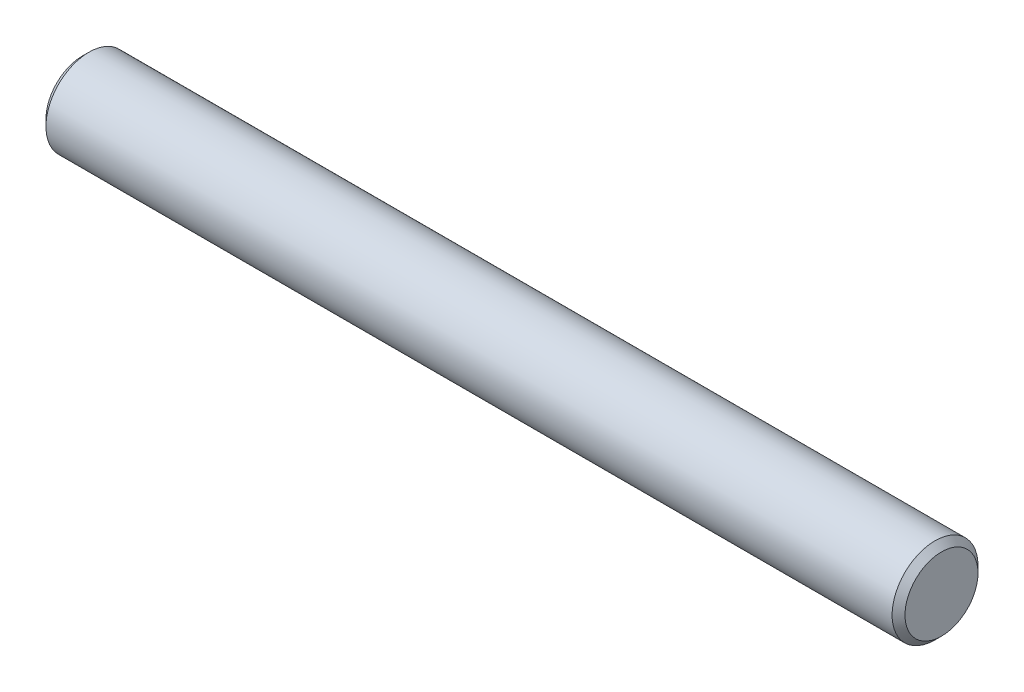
ISO-10303-21;
HEADER;
FILE_DESCRIPTION(('STEP AP214'),'2;1');
FILE_NAME('part.step','',(''),(''),'','','');
FILE_SCHEMA(('AUTOMOTIVE_DESIGN { 1 0 10303 214 1 1 1 1 }'));
ENDSEC;
DATA;
#1=APPLICATION_CONTEXT('core data for automotive mechanical design processes');
#2=APPLICATION_PROTOCOL_DEFINITION('international standard','automotive_design',2000,#1);
#3=PRODUCT_CONTEXT('',#1,'mechanical');
#4=PRODUCT('Part','Part','',(#3));
#5=PRODUCT_RELATED_PRODUCT_CATEGORY('part','',(#4));
#6=PRODUCT_DEFINITION_FORMATION('','',#4);
#7=PRODUCT_DEFINITION_CONTEXT('part definition',#1,'design');
#8=PRODUCT_DEFINITION('design','',#6,#7);
#9=PRODUCT_DEFINITION_SHAPE('','',#8);
#10=(LENGTH_UNIT() NAMED_UNIT(*) SI_UNIT(.MILLI.,.METRE.));
#11=(NAMED_UNIT(*) PLANE_ANGLE_UNIT() SI_UNIT($,.RADIAN.));
#12=(NAMED_UNIT(*) SI_UNIT($,.STERADIAN.) SOLID_ANGLE_UNIT());
#13=UNCERTAINTY_MEASURE_WITH_UNIT(LENGTH_MEASURE(1.E-05),#10,'distance_accuracy_value','');
#14=(GEOMETRIC_REPRESENTATION_CONTEXT(3) GLOBAL_UNCERTAINTY_ASSIGNED_CONTEXT((#13)) GLOBAL_UNIT_ASSIGNED_CONTEXT((#10,
#11,#12)) REPRESENTATION_CONTEXT('',''));
#15=CARTESIAN_POINT('',(0.,0.,0.));
#16=DIRECTION('',(0.,0.,1.));
#17=DIRECTION('',(1.,0.,0.));
#18=AXIS2_PLACEMENT_3D('',#15,#16,#17);
#19=CARTESIAN_POINT('',(40.,0.,0.));
#20=DIRECTION('',(-1.,0.,0.));
#21=DIRECTION('',(0.,0.,1.));
#22=AXIS2_PLACEMENT_3D('',#19,#20,#21);
#23=CYLINDRICAL_SURFACE('',#22,2.);
#24=CARTESIAN_POINT('',(0.300000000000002,0.,0.));
#25=DIRECTION('',(1.,0.,0.));
#26=DIRECTION('',(0.,0.,-1.));
#27=AXIS2_PLACEMENT_3D('',#24,#25,#26);
#28=CIRCLE('',#27,2.);
#29=CARTESIAN_POINT('',(0.300000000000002,0.,-2.));
#30=VERTEX_POINT('',#29);
#31=EDGE_CURVE('E41',#30,#30,#28,.T.);
#32=ORIENTED_EDGE('',*,*,#31,.T.);
#33=EDGE_LOOP('',(#32));
#34=FACE_BOUND('',#33,.T.);
#35=CARTESIAN_POINT('',(39.7,0.,0.));
#36=DIRECTION('',(1.,0.,0.));
#37=DIRECTION('',(0.,0.,-1.));
#38=AXIS2_PLACEMENT_3D('',#35,#36,#37);
#39=CIRCLE('',#38,2.);
#40=CARTESIAN_POINT('',(39.7,0.,-2.));
#41=VERTEX_POINT('',#40);
#42=EDGE_CURVE('E45',#41,#41,#39,.F.);
#43=ORIENTED_EDGE('',*,*,#42,.T.);
#44=EDGE_LOOP('',(#43));
#45=FACE_BOUND('',#44,.T.);
#46=ADVANCED_FACE('F30',(#34,#45),#23,.T.);
#47=CARTESIAN_POINT('',(40.,0.,0.));
#48=DIRECTION('',(1.,0.,0.));
#49=DIRECTION('',(0.,0.,-1.));
#50=AXIS2_PLACEMENT_3D('',#47,#48,#49);
#51=PLANE('',#50);
#52=CARTESIAN_POINT('',(40.,0.,0.));
#53=DIRECTION('',(1.,0.,0.));
#54=DIRECTION('',(0.,0.,-1.));
#55=AXIS2_PLACEMENT_3D('',#52,#53,#54);
#56=CIRCLE('',#55,1.7);
#57=CARTESIAN_POINT('',(40.,0.,-1.7));
#58=VERTEX_POINT('',#57);
#59=EDGE_CURVE('E10',#58,#58,#56,.T.);
#60=ORIENTED_EDGE('',*,*,#59,.T.);
#61=EDGE_LOOP('',(#60));
#62=FACE_BOUND('',#61,.T.);
#63=ADVANCED_FACE('F61',(#62),#51,.T.);
#64=CARTESIAN_POINT('',(0.,0.,0.));
#65=DIRECTION('',(1.,0.,0.));
#66=DIRECTION('',(0.,0.,-1.));
#67=AXIS2_PLACEMENT_3D('',#64,#65,#66);
#68=PLANE('',#67);
#69=CARTESIAN_POINT('',(0.,0.,0.));
#70=DIRECTION('',(1.,0.,0.));
#71=DIRECTION('',(0.,0.,-1.));
#72=AXIS2_PLACEMENT_3D('',#69,#70,#71);
#73=CIRCLE('',#72,1.7);
#74=CARTESIAN_POINT('',(0.,0.,-1.7));
#75=VERTEX_POINT('',#74);
#76=EDGE_CURVE('E37',#75,#75,#73,.F.);
#77=ORIENTED_EDGE('',*,*,#76,.T.);
#78=EDGE_LOOP('',(#77));
#79=FACE_BOUND('',#78,.T.);
#80=ADVANCED_FACE('F58',(#79),#68,.F.);
#81=CARTESIAN_POINT('',(0.300000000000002,0.,0.));
#82=DIRECTION('',(1.,0.,0.));
#83=DIRECTION('',(0.,0.,-1.));
#84=AXIS2_PLACEMENT_3D('',#81,#82,#83);
#85=CONICAL_SURFACE('',#84,2.,0.785398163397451);
#86=ORIENTED_EDGE('',*,*,#76,.F.);
#87=EDGE_LOOP('',(#86));
#88=FACE_BOUND('',#87,.T.);
#89=ORIENTED_EDGE('',*,*,#31,.F.);
#90=EDGE_LOOP('',(#89));
#91=FACE_BOUND('',#90,.T.);
#92=ADVANCED_FACE('F54',(#88,#91),#85,.T.);
#93=CARTESIAN_POINT('',(40.,0.,0.));
#94=DIRECTION('',(-1.,0.,0.));
#95=DIRECTION('',(0.,0.,1.));
#96=AXIS2_PLACEMENT_3D('',#93,#94,#95);
#97=CONICAL_SURFACE('',#96,1.7,0.785398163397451);
#98=ORIENTED_EDGE('',*,*,#42,.F.);
#99=EDGE_LOOP('',(#98));
#100=FACE_BOUND('',#99,.T.);
#101=ORIENTED_EDGE('',*,*,#59,.F.);
#102=EDGE_LOOP('',(#101));
#103=FACE_BOUND('',#102,.T.);
#104=ADVANCED_FACE('F32',(#100,#103),#97,.T.);
#105=CLOSED_SHELL('',(#46,#63,#80,#92,#104));
#106=MANIFOLD_SOLID_BREP('B2',#105);
#107=ADVANCED_BREP_SHAPE_REPRESENTATION('',(#18,#106),#14);
#108=SHAPE_DEFINITION_REPRESENTATION(#9,#107);
ENDSEC;
END-ISO-10303-21;
